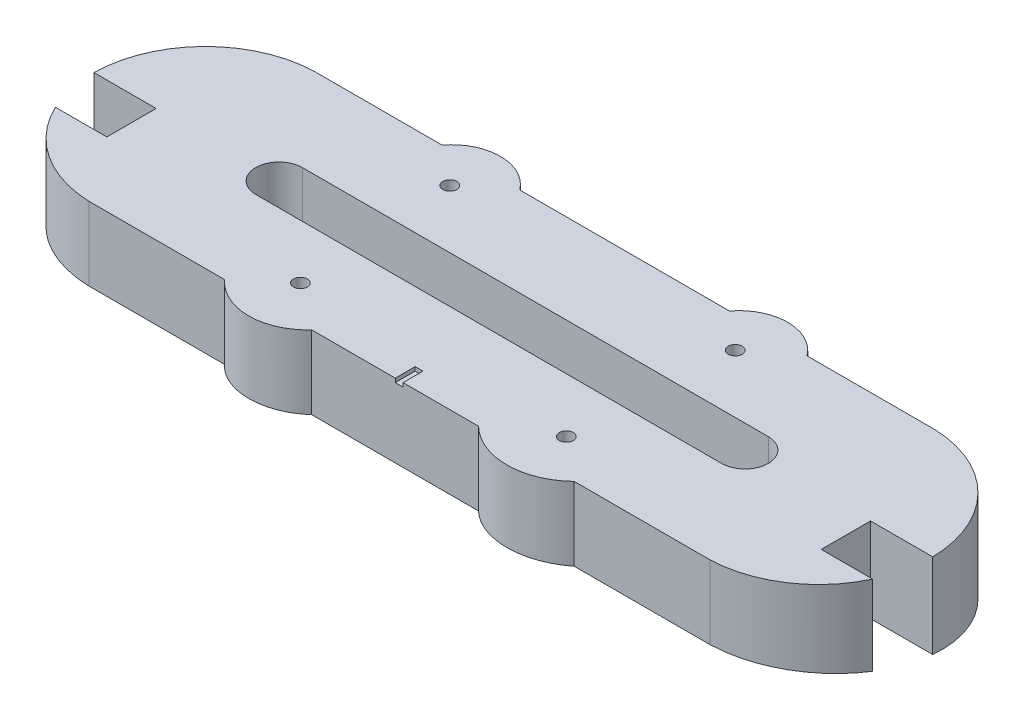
from build123d import *

# Parameters (mm, degrees)
SKETCH2_W               = 216
SKETCH2_H               = 68
BOSS_EXTRUDE1_DEPTH     = 12
CUT_EXTRUDE1_DEPTH      = 122.718290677
CUT_EXTRUDE2_DEPTH      = 12
CUT_EXTRUDE3_DEPTH      = 12
SKETCH7_R               = 1.8
CUT_EXTRUDE4_DEPTH      = 9
SKETCH8_W               = 2
SKETCH8_H               = 5.121249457
CUT_EXTRUDE5_DEPTH      = 1
BOSS_EXTRUDE2_DEPTH     = 20
CUT_EXTRUDE9_DEPTH      = 123.763422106
CUT_EXTRUDE9_DEPTH_BACK = 123.763422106


with BuildPart() as part:
    # Sketch2 → Boss-Extrude1 (new body)
    with BuildSketch(Plane(origin=(0, 0, 0), x_dir=(1, 0, 0), z_dir=(0, 1, 0))):
        with Locations((6.760305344, 4.748091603)):
            Rectangle(SKETCH2_W, SKETCH2_H)
    extrude(amount=BOSS_EXTRUDE1_DEPTH)

    # Sketch3 → Cut-Extrude1 (cut, through all)
    with BuildSketch(Plane(origin=(0, 12, 0), x_dir=(1, 0, 0), z_dir=(0, 1, 0))):
        with BuildLine():
            Line((-53.239694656, 10.748091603), (66.760305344, 10.748091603))
            ThreePointArc((66.760305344, 10.748091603), (72.760305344, 4.748091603), (66.760305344, -1.251908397))
            Line((66.760305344, -1.251908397), (-53.239694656, -1.251908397))
            ThreePointArc((-53.239694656, -1.251908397), (-59.239694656, 4.748091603), (-53.239694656, 10.748091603))
        make_face()
    extrude(amount=-CUT_EXTRUDE1_DEPTH, mode=Mode.SUBTRACT)

    # Sketch4 → Cut-Extrude2 (cut)
    with BuildSketch(Plane(origin=(0, 12, 0), x_dir=(1, 0, 0), z_dir=(0, 1, 0))):
        with BuildLine():
            Line((130.760305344, -7.601908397), (98.760305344, -7.601908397))
            Line((98.760305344, -7.601908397), (98.760305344, 5.098091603))
            Line((98.760305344, 5.098091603), (130.760305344, 5.098091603))
            ThreePointArc((130.760305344, 5.098091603), (137.110305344, -1.251908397), (130.760305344, -7.601908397))
        make_face()
        with BuildLine():
            Line((-117.239694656, -7.601908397), (-85.239694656, -7.601908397))
            Line((-85.239694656, -7.601908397), (-85.239694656, 5.098091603))
            Line((-85.239694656, 5.098091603), (-117.239694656, 5.098091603))
            ThreePointArc((-117.239694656, 5.098091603), (-123.589694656, -1.251908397), (-117.239694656, -7.601908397))
        make_face()
    extrude(amount=-CUT_EXTRUDE2_DEPTH, mode=Mode.SUBTRACT)

    # Sketch6 → Cut-Extrude3 (cut)
    with BuildSketch(Plane(origin=(0, 12, 0), x_dir=(1, 0, 0), z_dir=(0, 1, 0))):
        with BuildLine():
            Line((-73.239694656, 33.748091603), (-40.239694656, 33.748091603))
            ThreePointArc((-40.239694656, 33.748091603), (-35.82986468, 37.428431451), (-30.239694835, 38.748091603))
            Line((-30.239694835, 38.748091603), (-101.239694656, 38.748091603))
            Line((-101.239694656, 38.748091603), (-101.239694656, 5.098091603))
            Line((-101.239694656, 5.098091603), (-101.23758381, 5.098091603))
            ThreePointArc((-101.23758381, 5.098091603), (-92.975390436, 25.02926697), (-73.239694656, 33.748091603))
        make_face()
        with BuildLine():
            Line((43.76030547, 38.748091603), (-30.239694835, 38.748091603))
            ThreePointArc((-30.239694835, 38.748091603), (-24.649524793, 37.428431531), (-20.239694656, 33.748091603))
            Line((-20.239694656, 33.748091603), (33.760305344, 33.748091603))
            ThreePointArc((33.760305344, 33.748091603), (38.170135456, 37.428431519), (43.76030547, 38.748091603))
        make_face()
        with BuildLine():
            Line((114.760305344, 38.748091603), (43.76030547, 38.748091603))
            ThreePointArc((43.76030547, 38.748091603), (49.350475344, 37.428431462), (53.760305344, 33.748091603))
            Line((53.760305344, 33.748091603), (86.760305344, 33.748091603))
            ThreePointArc((86.760305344, 33.748091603), (106.496001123, 25.02926697), (114.758194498, 5.098091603))
            Line((114.758194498, 5.098091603), (114.760305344, 5.098091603))
            Line((114.760305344, 5.098091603), (114.760305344, 38.748091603))
        make_face()
        with BuildLine():
            ThreePointArc((-73.239694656, -24.251908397), (-88.200159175, -19.474403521), (-98.480427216, -7.601908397))
            Line((-98.480427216, -7.601908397), (-101.239694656, -7.601908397))
            Line((-101.239694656, -7.601908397), (-101.239694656, -29.251908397))
            Line((-101.239694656, -29.251908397), (-27.05112807, -29.251908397))
            ThreePointArc((-27.05112807, -29.251908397), (-33.17860761, -27.945048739), (-38.239694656, -24.251908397))
            Line((-38.239694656, -24.251908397), (-73.239694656, -24.251908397))
        make_face()
        with BuildLine():
            ThreePointArc((-15.86256139, -24.251908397), (-20.923648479, -27.945048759), (-27.05112807, -29.251908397))
            Line((-27.05112807, -29.251908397), (39.448871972, -29.251908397))
            ThreePointArc((39.448871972, -29.251908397), (32.804863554, -27.954222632), (27.13743861, -24.251908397))
            Line((27.13743861, -24.251908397), (-15.86256139, -24.251908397))
        make_face()
        with BuildLine():
            Line((114.760305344, -7.601908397), (112.001037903, -7.601908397))
            ThreePointArc((112.001037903, -7.601908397), (101.720769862, -19.474403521), (86.760305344, -24.251908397))
            Line((86.760305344, -24.251908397), (51.760305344, -24.251908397))
            ThreePointArc((51.760305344, -24.251908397), (46.092880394, -27.954222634), (39.448871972, -29.251908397))
            Line((39.448871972, -29.251908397), (114.760305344, -29.251908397))
            Line((114.760305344, -29.251908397), (114.760305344, -7.601908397))
        make_face()
    extrude(amount=-CUT_EXTRUDE3_DEPTH, mode=Mode.SUBTRACT)

    # Sketch7 → Cut-Extrude4 (cut)
    with BuildSketch(Plane(origin=(0, 12, 0), x_dir=(1, 0, 0), z_dir=(0, 1, 0))):
        with Locations(Location((-27.739694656, -15.251908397, 0), (0, 0, 270))):
            Circle(SKETCH7_R)
        with Locations(Location((40.760305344, -15.251908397, 0), (0, 0, 270))):
            Circle(SKETCH7_R)
        with Locations(Location((43.260305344, 25.748091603, 0), (0, 0, 270))):
            Circle(SKETCH7_R)
        with Locations(Location((-30.239694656, 25.748091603, 0), (0, 0, 270))):
            Circle(SKETCH7_R)
    extrude(amount=-CUT_EXTRUDE4_DEPTH, mode=Mode.SUBTRACT)

    # Sketch8 → Cut-Extrude5 (cut)
    with BuildSketch(Plane(origin=(0, 12, 0), x_dir=(1, 0, 0), z_dir=(0, 1, 0))):
        with Locations((6.700077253, -21.691283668)):
            Rectangle(SKETCH8_W, SKETCH8_H)
    extrude(amount=-CUT_EXTRUDE5_DEPTH, mode=Mode.SUBTRACT)

    # Sketch12 → Boss-Extrude2 (add)
    with BuildSketch(Plane.XZ):
        with BuildLine():
            Line((-73.239694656, -33.748091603), (-40.239694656, -33.748091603))
            ThreePointArc((-40.239694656, -33.748091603), (-30.239694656, -38.748091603), (-20.239694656, -33.748091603))
            Line((-20.239694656, -33.748091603), (33.760305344, -33.748091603))
            ThreePointArc((33.760305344, -33.748091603), (43.760305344, -38.748091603), (53.760305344, -33.748091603))
            Line((53.760305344, -33.748091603), (86.760305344, -33.748091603))
            ThreePointArc((86.760305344, -33.748091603), (106.496001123, -25.02926697), (114.758194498, -5.098091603))
            Line((114.758194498, -5.098091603), (98.760305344, -5.098091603))
            Line((98.760305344, -5.098091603), (98.760305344, 7.601908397))
            Line((98.760305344, 7.601908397), (112.001037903, 7.601908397))
            ThreePointArc((112.001037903, 7.601908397), (101.720769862, 19.474403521), (86.760305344, 24.251908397))
            Line((86.760305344, 24.251908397), (51.760305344, 24.251908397))
            ThreePointArc((51.760305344, 24.251908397), (39.448871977, 29.251908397), (27.13743861, 24.251908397))
            Line((27.13743861, 24.251908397), (-15.86256139, 24.251908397))
            ThreePointArc((-15.86256139, 24.251908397), (-27.051128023, 29.251908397), (-38.239694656, 24.251908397))
            Line((-38.239694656, 24.251908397), (-73.239694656, 24.251908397))
            ThreePointArc((-73.239694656, 24.251908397), (-88.200159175, 19.474403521), (-98.480427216, 7.601908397))
            Line((-98.480427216, 7.601908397), (-85.239694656, 7.601908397))
            Line((-85.239694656, 7.601908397), (-85.239694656, -5.098091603))
            Line((-85.239694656, -5.098091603), (-101.23758381, -5.098091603))
            ThreePointArc((-101.23758381, -5.098091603), (-92.975390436, -25.02926697), (-73.239694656, -33.748091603))
        make_face()
        with BuildLine():
            Line((66.760305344, -10.748091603), (-53.239694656, -10.748091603))
            ThreePointArc((-53.239694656, -10.748091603), (-59.239694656, -4.748091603), (-53.239694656, 1.251908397))
            Line((-53.239694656, 1.251908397), (66.760305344, 1.251908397))
            ThreePointArc((66.760305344, 1.251908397), (72.760305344, -4.748091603), (66.760305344, -10.748091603))
        make_face(mode=Mode.SUBTRACT)
    extrude(amount=BOSS_EXTRUDE2_DEPTH)

    # Sketch14 → Cut-Extrude9 (cut, two sides: drawn at the far end of the back side and taken through both)
    with BuildSketch(Plane(origin=(0, 0, 0), x_dir=(0, 0, -1), z_dir=(1, 0, 0)).offset(-CUT_EXTRUDE9_DEPTH_BACK)):
        Polygon((38.748091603, -13.119016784), (-29.251908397, -6.427592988), (-29.251908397, -20), (38.748091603, -20), align=None)
    extrude(amount=CUT_EXTRUDE9_DEPTH + CUT_EXTRUDE9_DEPTH_BACK, mode=Mode.SUBTRACT)


solid = part.part
